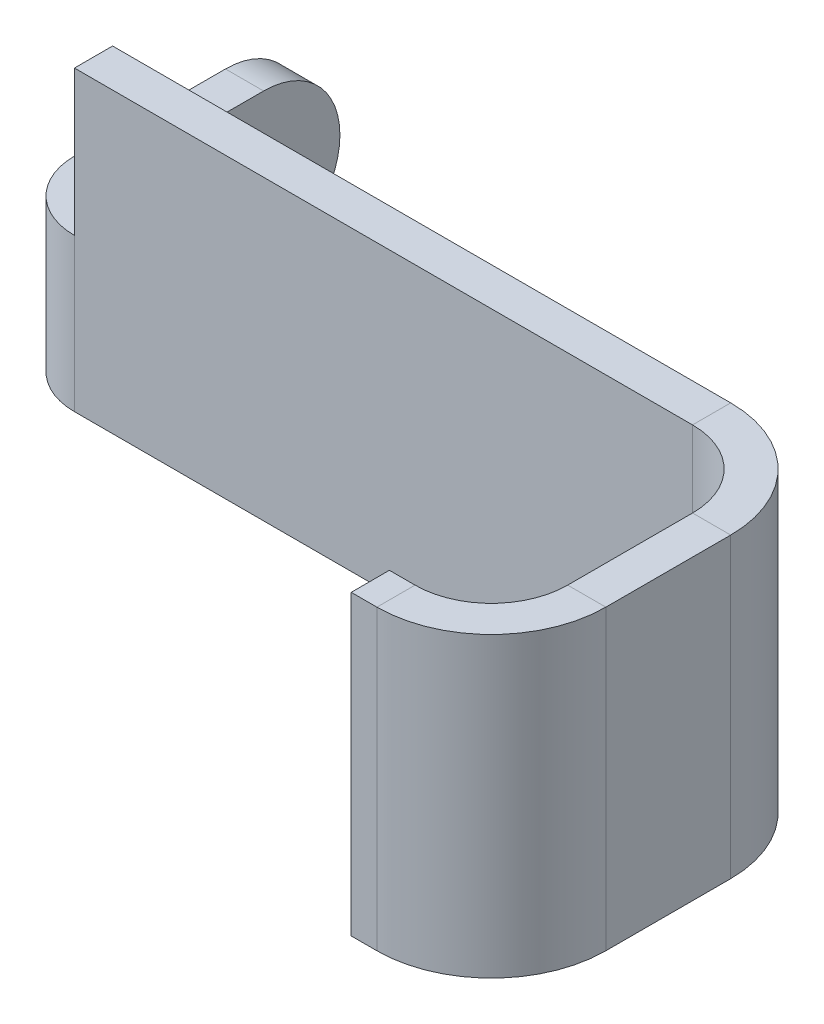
ISO-10303-21;
HEADER;
FILE_DESCRIPTION(('STEP AP214'),'2;1');
FILE_NAME('part.step','',(''),(''),'','','');
FILE_SCHEMA(('AUTOMOTIVE_DESIGN { 1 0 10303 214 1 1 1 1 }'));
ENDSEC;
DATA;
#1=APPLICATION_CONTEXT('core data for automotive mechanical design processes');
#2=APPLICATION_PROTOCOL_DEFINITION('international standard','automotive_design',2000,#1);
#3=PRODUCT_CONTEXT('',#1,'mechanical');
#4=PRODUCT('Part','Part','',(#3));
#5=PRODUCT_RELATED_PRODUCT_CATEGORY('part','',(#4));
#6=PRODUCT_DEFINITION_FORMATION('','',#4);
#7=PRODUCT_DEFINITION_CONTEXT('part definition',#1,'design');
#8=PRODUCT_DEFINITION('design','',#6,#7);
#9=PRODUCT_DEFINITION_SHAPE('','',#8);
#10=(LENGTH_UNIT() NAMED_UNIT(*) SI_UNIT(.MILLI.,.METRE.));
#11=(NAMED_UNIT(*) PLANE_ANGLE_UNIT() SI_UNIT($,.RADIAN.));
#12=(NAMED_UNIT(*) SI_UNIT($,.STERADIAN.) SOLID_ANGLE_UNIT());
#13=UNCERTAINTY_MEASURE_WITH_UNIT(LENGTH_MEASURE(1.E-05),#10,'distance_accuracy_value','');
#14=(GEOMETRIC_REPRESENTATION_CONTEXT(3) GLOBAL_UNCERTAINTY_ASSIGNED_CONTEXT((#13)) GLOBAL_UNIT_ASSIGNED_CONTEXT((#10,
#11,#12)) REPRESENTATION_CONTEXT('',''));
#15=CARTESIAN_POINT('',(0.,0.,0.));
#16=DIRECTION('',(0.,0.,1.));
#17=DIRECTION('',(1.,0.,0.));
#18=AXIS2_PLACEMENT_3D('',#15,#16,#17);
#19=CARTESIAN_POINT('',(9.01398601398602,0.,-0.25));
#20=DIRECTION('',(0.,-1.,0.));
#21=DIRECTION('',(1.,0.,0.));
#22=AXIS2_PLACEMENT_3D('',#19,#20,#21);
#23=PLANE('',#22);
#24=DIRECTION('',(1.,0.,0.));
#25=VECTOR('',#24,1.);
#26=CARTESIAN_POINT('',(9.01398601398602,0.,0.));
#27=LINE('',#26,#25);
#28=CARTESIAN_POINT('',(2.01398601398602,0.,0.));
#29=VERTEX_POINT('',#28);
#30=CARTESIAN_POINT('',(6.06398601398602,0.,0.));
#31=VERTEX_POINT('',#30);
#32=EDGE_CURVE('E351',#29,#31,#27,.T.);
#33=ORIENTED_EDGE('',*,*,#32,.F.);
#34=DIRECTION('',(0.,0.,-1.));
#35=VECTOR('',#34,1.);
#36=CARTESIAN_POINT('',(2.01398601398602,0.,-0.25));
#37=LINE('',#36,#35);
#38=CARTESIAN_POINT('',(2.01398601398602,0.,-0.25));
#39=VERTEX_POINT('',#38);
#40=EDGE_CURVE('E421',#29,#39,#37,.T.);
#41=ORIENTED_EDGE('',*,*,#40,.T.);
#42=DIRECTION('',(1.,0.,0.));
#43=VECTOR('',#42,1.);
#44=CARTESIAN_POINT('',(9.01398601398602,0.,-0.25));
#45=LINE('',#44,#43);
#46=CARTESIAN_POINT('',(6.06398601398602,0.,-0.25));
#47=VERTEX_POINT('',#46);
#48=EDGE_CURVE('E57',#39,#47,#45,.T.);
#49=ORIENTED_EDGE('',*,*,#48,.T.);
#50=DIRECTION('',(0.,0.,1.));
#51=VECTOR('',#50,1.);
#52=CARTESIAN_POINT('',(6.06398601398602,0.,-0.25));
#53=LINE('',#52,#51);
#54=EDGE_CURVE('E359',#47,#31,#53,.T.);
#55=ORIENTED_EDGE('',*,*,#54,.T.);
#56=EDGE_LOOP('',(#33,#41,#49,#55));
#57=FACE_BOUND('',#56,.T.);
#58=ADVANCED_FACE('F53',(#57),#23,.T.);
#59=CARTESIAN_POINT('',(0.,0.,-0.25));
#60=DIRECTION('',(0.,0.,-1.));
#61=DIRECTION('',(-1.,0.,0.));
#62=AXIS2_PLACEMENT_3D('',#59,#60,#61);
#63=PLANE('',#62);
#64=ORIENTED_EDGE('',*,*,#48,.F.);
#65=DIRECTION('',(0.,1.,0.));
#66=VECTOR('',#65,1.);
#67=CARTESIAN_POINT('',(2.01398601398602,0.,-0.25));
#68=LINE('',#67,#66);
#69=CARTESIAN_POINT('',(2.01398601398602,1.,-0.25));
#70=VERTEX_POINT('',#69);
#71=EDGE_CURVE('E405',#39,#70,#68,.T.);
#72=ORIENTED_EDGE('',*,*,#71,.T.);
#73=DIRECTION('',(0.,-1.,0.));
#74=VECTOR('',#73,1.);
#75=CARTESIAN_POINT('',(2.01398601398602,1.,-0.25));
#76=LINE('',#75,#74);
#77=CARTESIAN_POINT('',(2.01398601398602,1.95,-0.25));
#78=VERTEX_POINT('',#77);
#79=EDGE_CURVE('E367',#78,#70,#76,.T.);
#80=ORIENTED_EDGE('',*,*,#79,.F.);
#81=DIRECTION('',(-1.,0.,0.));
#82=VECTOR('',#81,1.);
#83=CARTESIAN_POINT('',(2.01398601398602,1.95,-0.25));
#84=LINE('',#83,#82);
#85=CARTESIAN_POINT('',(6.06398601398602,1.95,-0.25));
#86=VERTEX_POINT('',#85);
#87=EDGE_CURVE('E344',#86,#78,#84,.T.);
#88=ORIENTED_EDGE('',*,*,#87,.F.);
#89=DIRECTION('',(0.,-1.,0.));
#90=VECTOR('',#89,1.);
#91=CARTESIAN_POINT('',(6.06398601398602,0.,-0.25));
#92=LINE('',#91,#90);
#93=EDGE_CURVE('E363',#86,#47,#92,.T.);
#94=ORIENTED_EDGE('',*,*,#93,.T.);
#95=EDGE_LOOP('',(#64,#72,#80,#88,#94));
#96=FACE_BOUND('',#95,.T.);
#97=ADVANCED_FACE('F444',(#96),#63,.T.);
#98=CARTESIAN_POINT('',(6.81398601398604,0.,-6.54573371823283));
#99=DIRECTION('',(1.,0.,0.));
#100=DIRECTION('',(0.,0.,-1.));
#101=AXIS2_PLACEMENT_3D('',#98,#99,#100);
#102=PLANE('',#101);
#103=DIRECTION('',(0.,0.,-1.));
#104=VECTOR('',#103,1.);
#105=CARTESIAN_POINT('',(6.81398601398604,1.95,-4.53174770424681));
#106=LINE('',#105,#104);
#107=CARTESIAN_POINT('',(6.81398601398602,1.95,1.31825229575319));
#108=VERTEX_POINT('',#107);
#109=CARTESIAN_POINT('',(6.81398601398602,1.95,0.500000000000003));
#110=VERTEX_POINT('',#109);
#111=EDGE_CURVE('E379',#108,#110,#106,.T.);
#112=ORIENTED_EDGE('',*,*,#111,.F.);
#113=DIRECTION('',(0.,-1.,0.));
#114=VECTOR('',#113,1.);
#115=CARTESIAN_POINT('',(6.81398601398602,0.,1.31825229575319));
#116=LINE('',#115,#114);
#117=CARTESIAN_POINT('',(6.81398601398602,0.,1.31825229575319));
#118=VERTEX_POINT('',#117);
#119=EDGE_CURVE('E391',#108,#118,#116,.T.);
#120=ORIENTED_EDGE('',*,*,#119,.T.);
#121=DIRECTION('',(0.,0.,1.));
#122=VECTOR('',#121,1.);
#123=CARTESIAN_POINT('',(6.81398601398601,0.,2.46825229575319));
#124=LINE('',#123,#122);
#125=CARTESIAN_POINT('',(6.81398601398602,0.,0.500000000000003));
#126=VERTEX_POINT('',#125);
#127=EDGE_CURVE('E406',#126,#118,#124,.T.);
#128=ORIENTED_EDGE('',*,*,#127,.F.);
#129=DIRECTION('',(0.,-1.,0.));
#130=VECTOR('',#129,1.);
#131=CARTESIAN_POINT('',(6.81398601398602,0.,0.500000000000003));
#132=LINE('',#131,#130);
#133=EDGE_CURVE('E374',#110,#126,#132,.T.);
#134=ORIENTED_EDGE('',*,*,#133,.F.);
#135=EDGE_LOOP('',(#112,#120,#128,#134));
#136=FACE_BOUND('',#135,.T.);
#137=ADVANCED_FACE('F455',(#136),#102,.T.);
#138=CARTESIAN_POINT('',(6.81398601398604,1.95,-4.53174770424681));
#139=DIRECTION('',(0.,1.,0.));
#140=DIRECTION('',(-1.,0.,0.));
#141=AXIS2_PLACEMENT_3D('',#138,#139,#140);
#142=PLANE('',#141);
#143=DIRECTION('',(0.,0.,-1.));
#144=VECTOR('',#143,1.);
#145=CARTESIAN_POINT('',(6.56398601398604,1.95,-4.53174770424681));
#146=LINE('',#145,#144);
#147=CARTESIAN_POINT('',(6.56398601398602,1.95,1.31825229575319));
#148=VERTEX_POINT('',#147);
#149=CARTESIAN_POINT('',(6.56398601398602,1.95,0.500000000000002));
#150=VERTEX_POINT('',#149);
#151=EDGE_CURVE('E410',#148,#150,#146,.T.);
#152=ORIENTED_EDGE('',*,*,#151,.F.);
#153=DIRECTION('',(1.,0.,0.));
#154=VECTOR('',#153,1.);
#155=CARTESIAN_POINT('',(6.81398601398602,1.95,1.31825229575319));
#156=LINE('',#155,#154);
#157=EDGE_CURVE('E395',#148,#108,#156,.T.);
#158=ORIENTED_EDGE('',*,*,#157,.T.);
#159=ORIENTED_EDGE('',*,*,#111,.T.);
#160=DIRECTION('',(1.,0.,0.));
#161=VECTOR('',#160,1.);
#162=CARTESIAN_POINT('',(6.81398601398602,1.95,0.500000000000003));
#163=LINE('',#162,#161);
#164=EDGE_CURVE('E387',#150,#110,#163,.T.);
#165=ORIENTED_EDGE('',*,*,#164,.F.);
#166=EDGE_LOOP('',(#152,#158,#159,#165));
#167=FACE_BOUND('',#166,.T.);
#168=ADVANCED_FACE('F461',(#167),#142,.T.);
#169=CARTESIAN_POINT('',(6.81398601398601,0.,2.46825229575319));
#170=DIRECTION('',(0.,-1.,0.));
#171=DIRECTION('',(0.,0.,1.));
#172=AXIS2_PLACEMENT_3D('',#169,#170,#171);
#173=PLANE('',#172);
#174=ORIENTED_EDGE('',*,*,#127,.T.);
#175=DIRECTION('',(-1.,0.,0.));
#176=VECTOR('',#175,1.);
#177=CARTESIAN_POINT('',(6.81398601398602,0.,1.31825229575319));
#178=LINE('',#177,#176);
#179=CARTESIAN_POINT('',(6.56398601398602,0.,1.31825229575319));
#180=VERTEX_POINT('',#179);
#181=EDGE_CURVE('E401',#118,#180,#178,.T.);
#182=ORIENTED_EDGE('',*,*,#181,.T.);
#183=DIRECTION('',(0.,0.,1.));
#184=VECTOR('',#183,1.);
#185=CARTESIAN_POINT('',(6.56398601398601,0.,2.46825229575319));
#186=LINE('',#185,#184);
#187=CARTESIAN_POINT('',(6.56398601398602,0.,0.500000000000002));
#188=VERTEX_POINT('',#187);
#189=EDGE_CURVE('E343',#188,#180,#186,.T.);
#190=ORIENTED_EDGE('',*,*,#189,.F.);
#191=DIRECTION('',(-1.,0.,0.));
#192=VECTOR('',#191,1.);
#193=CARTESIAN_POINT('',(6.81398601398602,0.,0.500000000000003));
#194=LINE('',#193,#192);
#195=EDGE_CURVE('E378',#126,#188,#194,.T.);
#196=ORIENTED_EDGE('',*,*,#195,.F.);
#197=EDGE_LOOP('',(#174,#182,#190,#196));
#198=FACE_BOUND('',#197,.T.);
#199=ADVANCED_FACE('F465',(#198),#173,.T.);
#200=CARTESIAN_POINT('',(6.56398601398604,0.,-6.54573371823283));
#201=DIRECTION('',(1.,0.,0.));
#202=DIRECTION('',(0.,0.,-1.));
#203=AXIS2_PLACEMENT_3D('',#200,#201,#202);
#204=PLANE('',#203);
#205=DIRECTION('',(0.,-1.,0.));
#206=VECTOR('',#205,1.);
#207=CARTESIAN_POINT('',(6.56398601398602,0.,1.31825229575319));
#208=LINE('',#207,#206);
#209=EDGE_CURVE('E78',#148,#180,#208,.T.);
#210=ORIENTED_EDGE('',*,*,#209,.F.);
#211=ORIENTED_EDGE('',*,*,#151,.T.);
#212=DIRECTION('',(0.,-1.,0.));
#213=VECTOR('',#212,1.);
#214=CARTESIAN_POINT('',(6.56398601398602,0.,0.500000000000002));
#215=LINE('',#214,#213);
#216=EDGE_CURVE('E383',#150,#188,#215,.T.);
#217=ORIENTED_EDGE('',*,*,#216,.T.);
#218=ORIENTED_EDGE('',*,*,#189,.T.);
#219=EDGE_LOOP('',(#210,#211,#217,#218));
#220=FACE_BOUND('',#219,.T.);
#221=ADVANCED_FACE('F463',(#220),#204,.F.);
#222=CARTESIAN_POINT('',(2.01398601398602,1.,-0.25));
#223=DIRECTION('',(-1.,0.,0.));
#224=DIRECTION('',(0.,0.,1.));
#225=AXIS2_PLACEMENT_3D('',#222,#223,#224);
#226=PLANE('',#225);
#227=DIRECTION('',(0.,-1.,0.));
#228=VECTOR('',#227,1.);
#229=CARTESIAN_POINT('',(2.01398601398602,1.,0.));
#230=LINE('',#229,#228);
#231=CARTESIAN_POINT('',(2.01398601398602,1.95,0.));
#232=VERTEX_POINT('',#231);
#233=CARTESIAN_POINT('',(2.01398601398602,1.,0.));
#234=VERTEX_POINT('',#233);
#235=EDGE_CURVE('E352',#232,#234,#230,.T.);
#236=ORIENTED_EDGE('',*,*,#235,.F.);
#237=DIRECTION('',(0.,0.,1.));
#238=VECTOR('',#237,1.);
#239=CARTESIAN_POINT('',(2.01398601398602,1.95,-0.25));
#240=LINE('',#239,#238);
#241=EDGE_CURVE('E339',#78,#232,#240,.T.);
#242=ORIENTED_EDGE('',*,*,#241,.F.);
#243=ORIENTED_EDGE('',*,*,#79,.T.);
#244=DIRECTION('',(0.,0.,1.));
#245=VECTOR('',#244,1.);
#246=CARTESIAN_POINT('',(2.01398601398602,1.,-0.25));
#247=LINE('',#246,#245);
#248=EDGE_CURVE('E12',#70,#234,#247,.T.);
#249=ORIENTED_EDGE('',*,*,#248,.T.);
#250=EDGE_LOOP('',(#236,#242,#243,#249));
#251=FACE_BOUND('',#250,.T.);
#252=ADVANCED_FACE('F512',(#251),#226,.T.);
#253=CARTESIAN_POINT('',(0.,0.,0.));
#254=DIRECTION('',(0.,0.,-1.));
#255=DIRECTION('',(-1.,0.,0.));
#256=AXIS2_PLACEMENT_3D('',#253,#254,#255);
#257=PLANE('',#256);
#258=DIRECTION('',(0.,1.,0.));
#259=VECTOR('',#258,1.);
#260=CARTESIAN_POINT('',(2.01398601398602,0.,0.));
#261=LINE('',#260,#259);
#262=EDGE_CURVE('E63',#29,#234,#261,.T.);
#263=ORIENTED_EDGE('',*,*,#262,.F.);
#264=ORIENTED_EDGE('',*,*,#32,.T.);
#265=DIRECTION('',(0.,-1.,0.));
#266=VECTOR('',#265,1.);
#267=CARTESIAN_POINT('',(6.06398601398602,0.,0.));
#268=LINE('',#267,#266);
#269=CARTESIAN_POINT('',(6.06398601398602,1.95,0.));
#270=VERTEX_POINT('',#269);
#271=EDGE_CURVE('E332',#270,#31,#268,.T.);
#272=ORIENTED_EDGE('',*,*,#271,.F.);
#273=DIRECTION('',(-1.,0.,0.));
#274=VECTOR('',#273,1.);
#275=CARTESIAN_POINT('',(2.01398601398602,1.95,0.));
#276=LINE('',#275,#274);
#277=EDGE_CURVE('E356',#270,#232,#276,.T.);
#278=ORIENTED_EDGE('',*,*,#277,.T.);
#279=ORIENTED_EDGE('',*,*,#235,.T.);
#280=EDGE_LOOP('',(#263,#264,#272,#278,#279));
#281=FACE_BOUND('',#280,.T.);
#282=ADVANCED_FACE('F55',(#281),#257,.F.);
#283=CARTESIAN_POINT('',(2.01398601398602,1.95,-0.25));
#284=DIRECTION('',(0.,1.,0.));
#285=DIRECTION('',(0.,0.,1.));
#286=AXIS2_PLACEMENT_3D('',#283,#284,#285);
#287=PLANE('',#286);
#288=ORIENTED_EDGE('',*,*,#277,.F.);
#289=DIRECTION('',(0.,0.,-1.));
#290=VECTOR('',#289,1.);
#291=CARTESIAN_POINT('',(6.06398601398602,1.95,-0.25));
#292=LINE('',#291,#290);
#293=EDGE_CURVE('E347',#270,#86,#292,.T.);
#294=ORIENTED_EDGE('',*,*,#293,.T.);
#295=ORIENTED_EDGE('',*,*,#87,.T.);
#296=ORIENTED_EDGE('',*,*,#241,.T.);
#297=EDGE_LOOP('',(#288,#294,#295,#296));
#298=FACE_BOUND('',#297,.T.);
#299=ADVANCED_FACE('F517',(#298),#287,.T.);
#300=CARTESIAN_POINT('',(6.06398601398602,1.95,0.5));
#301=DIRECTION('',(0.,1.,0.));
#302=DIRECTION('',(0.,0.,1.));
#303=AXIS2_PLACEMENT_3D('',#300,#301,#302);
#304=PLANE('',#303);
#305=ORIENTED_EDGE('',*,*,#293,.F.);
#306=CARTESIAN_POINT('',(6.06398601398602,1.95,0.5));
#307=DIRECTION('',(0.,-1.,0.));
#308=DIRECTION('',(0.,0.,-1.));
#309=AXIS2_PLACEMENT_3D('',#306,#307,#308);
#310=CIRCLE('',#309,0.5);
#311=EDGE_CURVE('E317',#270,#150,#310,.T.);
#312=ORIENTED_EDGE('',*,*,#311,.T.);
#313=ORIENTED_EDGE('',*,*,#164,.T.);
#314=CARTESIAN_POINT('',(6.06398601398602,1.95,0.5));
#315=DIRECTION('',(0.,-1.,0.));
#316=DIRECTION('',(0.,0.,1.));
#317=AXIS2_PLACEMENT_3D('',#314,#315,#316);
#318=CIRCLE('',#317,0.75);
#319=EDGE_CURVE('E323',#86,#110,#318,.T.);
#320=ORIENTED_EDGE('',*,*,#319,.F.);
#321=EDGE_LOOP('',(#305,#312,#313,#320));
#322=FACE_BOUND('',#321,.T.);
#323=ADVANCED_FACE('F458',(#322),#304,.T.);
#324=CARTESIAN_POINT('',(6.06398601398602,0.,0.5));
#325=DIRECTION('',(0.,-1.,0.));
#326=DIRECTION('',(0.,0.,-1.));
#327=AXIS2_PLACEMENT_3D('',#324,#325,#326);
#328=PLANE('',#327);
#329=ORIENTED_EDGE('',*,*,#195,.T.);
#330=CARTESIAN_POINT('',(6.06398601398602,0.,0.5));
#331=DIRECTION('',(0.,-1.,0.));
#332=DIRECTION('',(0.,0.,-1.));
#333=AXIS2_PLACEMENT_3D('',#330,#331,#332);
#334=CIRCLE('',#333,0.5);
#335=EDGE_CURVE('E328',#188,#31,#334,.F.);
#336=ORIENTED_EDGE('',*,*,#335,.T.);
#337=ORIENTED_EDGE('',*,*,#54,.F.);
#338=CARTESIAN_POINT('',(6.06398601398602,0.,0.5));
#339=DIRECTION('',(0.,1.,0.));
#340=DIRECTION('',(0.,0.,-1.));
#341=AXIS2_PLACEMENT_3D('',#338,#339,#340);
#342=CIRCLE('',#341,0.75);
#343=EDGE_CURVE('E327',#126,#47,#342,.T.);
#344=ORIENTED_EDGE('',*,*,#343,.F.);
#345=EDGE_LOOP('',(#329,#336,#337,#344));
#346=FACE_BOUND('',#345,.T.);
#347=ADVANCED_FACE('F439',(#346),#328,.T.);
#348=CARTESIAN_POINT('',(6.06398601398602,3.17245956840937,0.5));
#349=DIRECTION('',(0.,-1.,0.));
#350=DIRECTION('',(0.,0.,-1.));
#351=AXIS2_PLACEMENT_3D('',#348,#349,#350);
#352=CYLINDRICAL_SURFACE('',#351,0.75);
#353=ORIENTED_EDGE('',*,*,#343,.T.);
#354=ORIENTED_EDGE('',*,*,#93,.F.);
#355=ORIENTED_EDGE('',*,*,#319,.T.);
#356=ORIENTED_EDGE('',*,*,#133,.T.);
#357=EDGE_LOOP('',(#353,#354,#355,#356));
#358=FACE_BOUND('',#357,.T.);
#359=ADVANCED_FACE('F450',(#358),#352,.T.);
#360=CARTESIAN_POINT('',(6.06398601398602,3.17245956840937,0.5));
#361=DIRECTION('',(0.,-1.,0.));
#362=DIRECTION('',(0.,0.,-1.));
#363=AXIS2_PLACEMENT_3D('',#360,#361,#362);
#364=CYLINDRICAL_SURFACE('',#363,0.5);
#365=ORIENTED_EDGE('',*,*,#335,.F.);
#366=ORIENTED_EDGE('',*,*,#216,.F.);
#367=ORIENTED_EDGE('',*,*,#311,.F.);
#368=ORIENTED_EDGE('',*,*,#271,.T.);
#369=EDGE_LOOP('',(#365,#366,#367,#368));
#370=FACE_BOUND('',#369,.T.);
#371=ADVANCED_FACE('F434',(#370),#364,.F.);
#372=CARTESIAN_POINT('',(6.06398601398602,1.95,1.31825229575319));
#373=DIRECTION('',(0.,1.,0.));
#374=DIRECTION('',(0.,0.,1.));
#375=AXIS2_PLACEMENT_3D('',#372,#373,#374);
#376=PLANE('',#375);
#377=ORIENTED_EDGE('',*,*,#157,.F.);
#378=CARTESIAN_POINT('',(6.06398601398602,1.95,1.31825229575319));
#379=DIRECTION('',(0.,-1.,0.));
#380=DIRECTION('',(0.,0.,-1.));
#381=AXIS2_PLACEMENT_3D('',#378,#379,#380);
#382=CIRCLE('',#381,0.5);
#383=CARTESIAN_POINT('',(6.06398601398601,1.95,1.81825229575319));
#384=VERTEX_POINT('',#383);
#385=EDGE_CURVE('E268',#148,#384,#382,.T.);
#386=ORIENTED_EDGE('',*,*,#385,.T.);
#387=DIRECTION('',(0.,0.,1.));
#388=VECTOR('',#387,1.);
#389=CARTESIAN_POINT('',(6.06398601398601,1.95,2.06825229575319));
#390=LINE('',#389,#388);
#391=CARTESIAN_POINT('',(6.06398601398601,1.95,2.06825229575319));
#392=VERTEX_POINT('',#391);
#393=EDGE_CURVE('E297',#384,#392,#390,.T.);
#394=ORIENTED_EDGE('',*,*,#393,.T.);
#395=CARTESIAN_POINT('',(6.06398601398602,1.95,1.31825229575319));
#396=DIRECTION('',(0.,-1.,0.));
#397=DIRECTION('',(0.,0.,1.));
#398=AXIS2_PLACEMENT_3D('',#395,#396,#397);
#399=CIRCLE('',#398,0.75);
#400=EDGE_CURVE('E308',#108,#392,#399,.T.);
#401=ORIENTED_EDGE('',*,*,#400,.F.);
#402=EDGE_LOOP('',(#377,#386,#394,#401));
#403=FACE_BOUND('',#402,.T.);
#404=ADVANCED_FACE('F483',(#403),#376,.T.);
#405=CARTESIAN_POINT('',(6.06398601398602,0.,1.31825229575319));
#406=DIRECTION('',(0.,-1.,0.));
#407=DIRECTION('',(0.,0.,-1.));
#408=AXIS2_PLACEMENT_3D('',#405,#406,#407);
#409=PLANE('',#408);
#410=DIRECTION('',(0.,0.,-1.));
#411=VECTOR('',#410,1.);
#412=CARTESIAN_POINT('',(6.06398601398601,0.,2.06825229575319));
#413=LINE('',#412,#411);
#414=CARTESIAN_POINT('',(6.06398601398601,0.,2.06825229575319));
#415=VERTEX_POINT('',#414);
#416=CARTESIAN_POINT('',(6.06398601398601,0.,1.81825229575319));
#417=VERTEX_POINT('',#416);
#418=EDGE_CURVE('E301',#415,#417,#413,.T.);
#419=ORIENTED_EDGE('',*,*,#418,.T.);
#420=CARTESIAN_POINT('',(6.06398601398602,0.,1.31825229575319));
#421=DIRECTION('',(0.,-1.,0.));
#422=DIRECTION('',(0.,0.,-1.));
#423=AXIS2_PLACEMENT_3D('',#420,#421,#422);
#424=CIRCLE('',#423,0.5);
#425=EDGE_CURVE('E313',#417,#180,#424,.F.);
#426=ORIENTED_EDGE('',*,*,#425,.T.);
#427=ORIENTED_EDGE('',*,*,#181,.F.);
#428=CARTESIAN_POINT('',(6.06398601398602,0.,1.31825229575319));
#429=DIRECTION('',(0.,1.,0.));
#430=DIRECTION('',(0.,0.,-1.));
#431=AXIS2_PLACEMENT_3D('',#428,#429,#430);
#432=CIRCLE('',#431,0.75);
#433=EDGE_CURVE('E312',#415,#118,#432,.T.);
#434=ORIENTED_EDGE('',*,*,#433,.F.);
#435=EDGE_LOOP('',(#419,#426,#427,#434));
#436=FACE_BOUND('',#435,.T.);
#437=ADVANCED_FACE('F468',(#436),#409,.T.);
#438=CARTESIAN_POINT('',(6.06398601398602,3.17245956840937,1.31825229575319));
#439=DIRECTION('',(0.,-1.,0.));
#440=DIRECTION('',(0.,0.,-1.));
#441=AXIS2_PLACEMENT_3D('',#438,#439,#440);
#442=CYLINDRICAL_SURFACE('',#441,0.75);
#443=ORIENTED_EDGE('',*,*,#433,.T.);
#444=ORIENTED_EDGE('',*,*,#119,.F.);
#445=ORIENTED_EDGE('',*,*,#400,.T.);
#446=DIRECTION('',(0.,-1.,0.));
#447=VECTOR('',#446,1.);
#448=CARTESIAN_POINT('',(6.06398601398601,0.,2.06825229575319));
#449=LINE('',#448,#447);
#450=EDGE_CURVE('E261',#392,#415,#449,.T.);
#451=ORIENTED_EDGE('',*,*,#450,.T.);
#452=EDGE_LOOP('',(#443,#444,#445,#451));
#453=FACE_BOUND('',#452,.T.);
#454=ADVANCED_FACE('F471',(#453),#442,.T.);
#455=CARTESIAN_POINT('',(6.06398601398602,3.17245956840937,1.31825229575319));
#456=DIRECTION('',(0.,-1.,0.));
#457=DIRECTION('',(0.,0.,-1.));
#458=AXIS2_PLACEMENT_3D('',#455,#456,#457);
#459=CYLINDRICAL_SURFACE('',#458,0.5);
#460=ORIENTED_EDGE('',*,*,#425,.F.);
#461=DIRECTION('',(0.,-1.,0.));
#462=VECTOR('',#461,1.);
#463=CARTESIAN_POINT('',(6.06398601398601,0.,1.81825229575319));
#464=LINE('',#463,#462);
#465=EDGE_CURVE('E279',#384,#417,#464,.T.);
#466=ORIENTED_EDGE('',*,*,#465,.F.);
#467=ORIENTED_EDGE('',*,*,#385,.F.);
#468=ORIENTED_EDGE('',*,*,#209,.T.);
#469=EDGE_LOOP('',(#460,#466,#467,#468));
#470=FACE_BOUND('',#469,.T.);
#471=ADVANCED_FACE('F484',(#470),#459,.F.);
#472=CARTESIAN_POINT('',(5.89573371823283,1.95,2.06825229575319));
#473=DIRECTION('',(-1.,0.,0.));
#474=DIRECTION('',(0.,0.,1.));
#475=AXIS2_PLACEMENT_3D('',#472,#473,#474);
#476=PLANE('',#475);
#477=DIRECTION('',(0.,1.,0.));
#478=VECTOR('',#477,1.);
#479=CARTESIAN_POINT('',(5.89573371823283,1.95,1.81825229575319));
#480=LINE('',#479,#478);
#481=CARTESIAN_POINT('',(5.89573371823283,0.,1.81825229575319));
#482=VERTEX_POINT('',#481);
#483=CARTESIAN_POINT('',(5.89573371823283,1.95,1.81825229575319));
#484=VERTEX_POINT('',#483);
#485=EDGE_CURVE('E272',#482,#484,#480,.T.);
#486=ORIENTED_EDGE('',*,*,#485,.F.);
#487=DIRECTION('',(0.,0.,-1.));
#488=VECTOR('',#487,1.);
#489=CARTESIAN_POINT('',(5.89573371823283,0.,2.06825229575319));
#490=LINE('',#489,#488);
#491=CARTESIAN_POINT('',(5.89573371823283,0.,2.06825229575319));
#492=VERTEX_POINT('',#491);
#493=EDGE_CURVE('E264',#492,#482,#490,.T.);
#494=ORIENTED_EDGE('',*,*,#493,.F.);
#495=DIRECTION('',(0.,1.,0.));
#496=VECTOR('',#495,1.);
#497=CARTESIAN_POINT('',(5.89573371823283,1.95,2.06825229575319));
#498=LINE('',#497,#496);
#499=CARTESIAN_POINT('',(5.89573371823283,1.95,2.06825229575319));
#500=VERTEX_POINT('',#499);
#501=EDGE_CURVE('E293',#492,#500,#498,.T.);
#502=ORIENTED_EDGE('',*,*,#501,.T.);
#503=DIRECTION('',(0.,0.,-1.));
#504=VECTOR('',#503,1.);
#505=CARTESIAN_POINT('',(5.89573371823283,1.95,2.06825229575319));
#506=LINE('',#505,#504);
#507=EDGE_CURVE('E290',#500,#484,#506,.T.);
#508=ORIENTED_EDGE('',*,*,#507,.T.);
#509=EDGE_LOOP('',(#486,#494,#502,#508));
#510=FACE_BOUND('',#509,.T.);
#511=ADVANCED_FACE('F492',(#510),#476,.T.);
#512=CARTESIAN_POINT('',(14.9097197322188,0.,2.06825229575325));
#513=DIRECTION('',(0.,0.,1.));
#514=DIRECTION('',(1.,0.,0.));
#515=AXIS2_PLACEMENT_3D('',#512,#513,#514);
#516=PLANE('',#515);
#517=ORIENTED_EDGE('',*,*,#450,.F.);
#518=DIRECTION('',(1.,0.,0.));
#519=VECTOR('',#518,1.);
#520=CARTESIAN_POINT('',(12.8957337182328,1.95,2.06825229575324));
#521=LINE('',#520,#519);
#522=EDGE_CURVE('E286',#500,#392,#521,.T.);
#523=ORIENTED_EDGE('',*,*,#522,.F.);
#524=ORIENTED_EDGE('',*,*,#501,.F.);
#525=DIRECTION('',(-1.,0.,0.));
#526=VECTOR('',#525,1.);
#527=CARTESIAN_POINT('',(5.89573371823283,0.,2.06825229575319));
#528=LINE('',#527,#526);
#529=EDGE_CURVE('E269',#415,#492,#528,.T.);
#530=ORIENTED_EDGE('',*,*,#529,.F.);
#531=EDGE_LOOP('',(#517,#523,#524,#530));
#532=FACE_BOUND('',#531,.T.);
#533=ADVANCED_FACE('F475',(#532),#516,.T.);
#534=CARTESIAN_POINT('',(12.8957337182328,1.95,2.06825229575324));
#535=DIRECTION('',(0.,1.,0.));
#536=DIRECTION('',(0.,0.,-1.));
#537=AXIS2_PLACEMENT_3D('',#534,#535,#536);
#538=PLANE('',#537);
#539=ORIENTED_EDGE('',*,*,#393,.F.);
#540=DIRECTION('',(1.,0.,0.));
#541=VECTOR('',#540,1.);
#542=CARTESIAN_POINT('',(12.8957337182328,1.95,1.81825229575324));
#543=LINE('',#542,#541);
#544=EDGE_CURVE('E283',#484,#384,#543,.T.);
#545=ORIENTED_EDGE('',*,*,#544,.F.);
#546=ORIENTED_EDGE('',*,*,#507,.F.);
#547=ORIENTED_EDGE('',*,*,#522,.T.);
#548=EDGE_LOOP('',(#539,#545,#546,#547));
#549=FACE_BOUND('',#548,.T.);
#550=ADVANCED_FACE('F479',(#549),#538,.T.);
#551=CARTESIAN_POINT('',(14.9097197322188,0.,1.81825229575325));
#552=DIRECTION('',(0.,0.,1.));
#553=DIRECTION('',(1.,0.,0.));
#554=AXIS2_PLACEMENT_3D('',#551,#552,#553);
#555=PLANE('',#554);
#556=ORIENTED_EDGE('',*,*,#544,.T.);
#557=ORIENTED_EDGE('',*,*,#465,.T.);
#558=DIRECTION('',(-1.,0.,0.));
#559=VECTOR('',#558,1.);
#560=CARTESIAN_POINT('',(5.89573371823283,0.,1.81825229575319));
#561=LINE('',#560,#559);
#562=EDGE_CURVE('E276',#417,#482,#561,.T.);
#563=ORIENTED_EDGE('',*,*,#562,.T.);
#564=ORIENTED_EDGE('',*,*,#485,.T.);
#565=EDGE_LOOP('',(#556,#557,#563,#564));
#566=FACE_BOUND('',#565,.T.);
#567=ADVANCED_FACE('F486',(#566),#555,.F.);
#568=CARTESIAN_POINT('',(5.89573371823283,0.,2.06825229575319));
#569=DIRECTION('',(0.,-1.,0.));
#570=DIRECTION('',(-1.,0.,0.));
#571=AXIS2_PLACEMENT_3D('',#568,#569,#570);
#572=PLANE('',#571);
#573=ORIENTED_EDGE('',*,*,#418,.F.);
#574=ORIENTED_EDGE('',*,*,#529,.T.);
#575=ORIENTED_EDGE('',*,*,#493,.T.);
#576=ORIENTED_EDGE('',*,*,#562,.F.);
#577=EDGE_LOOP('',(#573,#574,#575,#576));
#578=FACE_BOUND('',#577,.T.);
#579=ADVANCED_FACE('F488',(#578),#572,.T.);
#580=CARTESIAN_POINT('',(2.01398601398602,0.,-0.45));
#581=DIRECTION('',(0.,1.,0.));
#582=DIRECTION('',(0.,0.,1.));
#583=AXIS2_PLACEMENT_3D('',#580,#581,#582);
#584=PLANE('',#583);
#585=ORIENTED_EDGE('',*,*,#40,.F.);
#586=CARTESIAN_POINT('',(2.01398601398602,0.,-0.45));
#587=DIRECTION('',(0.,1.,0.));
#588=DIRECTION('',(0.,0.,1.));
#589=AXIS2_PLACEMENT_3D('',#586,#587,#588);
#590=CIRCLE('',#589,0.45);
#591=CARTESIAN_POINT('',(1.56398601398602,0.,-0.450000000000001));
#592=VERTEX_POINT('',#591);
#593=EDGE_CURVE('E211',#29,#592,#590,.F.);
#594=ORIENTED_EDGE('',*,*,#593,.T.);
#595=DIRECTION('',(1.,0.,0.));
#596=VECTOR('',#595,1.);
#597=CARTESIAN_POINT('',(1.81398601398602,0.,-0.45));
#598=LINE('',#597,#596);
#599=CARTESIAN_POINT('',(1.81398601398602,0.,-0.45));
#600=VERTEX_POINT('',#599);
#601=EDGE_CURVE('E244',#592,#600,#598,.T.);
#602=ORIENTED_EDGE('',*,*,#601,.T.);
#603=CARTESIAN_POINT('',(2.01398601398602,0.,-0.45));
#604=DIRECTION('',(0.,-1.,0.));
#605=DIRECTION('',(0.,0.,1.));
#606=AXIS2_PLACEMENT_3D('',#603,#604,#605);
#607=CIRCLE('',#606,0.2);
#608=EDGE_CURVE('E253',#39,#600,#607,.T.);
#609=ORIENTED_EDGE('',*,*,#608,.F.);
#610=EDGE_LOOP('',(#585,#594,#602,#609));
#611=FACE_BOUND('',#610,.T.);
#612=ADVANCED_FACE('F540',(#611),#584,.F.);
#613=CARTESIAN_POINT('',(2.01398601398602,1.,-0.45));
#614=DIRECTION('',(0.,-1.,0.));
#615=DIRECTION('',(0.,0.,-1.));
#616=AXIS2_PLACEMENT_3D('',#613,#614,#615);
#617=PLANE('',#616);
#618=DIRECTION('',(-1.,0.,0.));
#619=VECTOR('',#618,1.);
#620=CARTESIAN_POINT('',(1.81398601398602,1.,-0.450000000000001));
#621=LINE('',#620,#619);
#622=CARTESIAN_POINT('',(1.81398601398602,1.,-0.450000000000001));
#623=VERTEX_POINT('',#622);
#624=CARTESIAN_POINT('',(1.56398601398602,1.,-0.450000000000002));
#625=VERTEX_POINT('',#624);
#626=EDGE_CURVE('E191',#623,#625,#621,.T.);
#627=ORIENTED_EDGE('',*,*,#626,.T.);
#628=CARTESIAN_POINT('',(2.01398601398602,1.,-0.45));
#629=DIRECTION('',(0.,1.,0.));
#630=DIRECTION('',(0.,0.,1.));
#631=AXIS2_PLACEMENT_3D('',#628,#629,#630);
#632=CIRCLE('',#631,0.45);
#633=EDGE_CURVE('E215',#625,#234,#632,.T.);
#634=ORIENTED_EDGE('',*,*,#633,.T.);
#635=ORIENTED_EDGE('',*,*,#248,.F.);
#636=CARTESIAN_POINT('',(2.01398601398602,1.,-0.45));
#637=DIRECTION('',(0.,1.,0.));
#638=DIRECTION('',(0.,0.,-1.));
#639=AXIS2_PLACEMENT_3D('',#636,#637,#638);
#640=CIRCLE('',#639,0.2);
#641=EDGE_CURVE('E257',#623,#70,#640,.T.);
#642=ORIENTED_EDGE('',*,*,#641,.F.);
#643=EDGE_LOOP('',(#627,#634,#635,#642));
#644=FACE_BOUND('',#643,.T.);
#645=ADVANCED_FACE('F562',(#644),#617,.F.);
#646=CARTESIAN_POINT('',(2.01398601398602,-0.650269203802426,-0.45));
#647=DIRECTION('',(0.,1.,0.));
#648=DIRECTION('',(0.,0.,1.));
#649=AXIS2_PLACEMENT_3D('',#646,#647,#648);
#650=CYLINDRICAL_SURFACE('',#649,0.2);
#651=ORIENTED_EDGE('',*,*,#641,.T.);
#652=ORIENTED_EDGE('',*,*,#71,.F.);
#653=ORIENTED_EDGE('',*,*,#608,.T.);
#654=DIRECTION('',(0.,1.,0.));
#655=VECTOR('',#654,1.);
#656=CARTESIAN_POINT('',(1.81398601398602,0.,-0.450000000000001));
#657=LINE('',#656,#655);
#658=EDGE_CURVE('E250',#600,#623,#657,.T.);
#659=ORIENTED_EDGE('',*,*,#658,.T.);
#660=EDGE_LOOP('',(#651,#652,#653,#659));
#661=FACE_BOUND('',#660,.T.);
#662=ADVANCED_FACE('F570',(#661),#650,.F.);
#663=CARTESIAN_POINT('',(2.01398601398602,-0.650269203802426,-0.45));
#664=DIRECTION('',(0.,1.,0.));
#665=DIRECTION('',(0.,0.,1.));
#666=AXIS2_PLACEMENT_3D('',#663,#664,#665);
#667=CYLINDRICAL_SURFACE('',#666,0.45);
#668=ORIENTED_EDGE('',*,*,#633,.F.);
#669=DIRECTION('',(0.,1.,0.));
#670=VECTOR('',#669,1.);
#671=CARTESIAN_POINT('',(1.56398601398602,0.,-0.450000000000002));
#672=LINE('',#671,#670);
#673=EDGE_CURVE('E225',#592,#625,#672,.T.);
#674=ORIENTED_EDGE('',*,*,#673,.F.);
#675=ORIENTED_EDGE('',*,*,#593,.F.);
#676=ORIENTED_EDGE('',*,*,#262,.T.);
#677=EDGE_LOOP('',(#668,#674,#675,#676));
#678=FACE_BOUND('',#677,.T.);
#679=ADVANCED_FACE('F578',(#678),#667,.T.);
#680=CARTESIAN_POINT('',(1.81398601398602,0.5,-1.43949119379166));
#681=DIRECTION('',(-1.,0.,0.));
#682=DIRECTION('',(0.,0.,1.));
#683=AXIS2_PLACEMENT_3D('',#680,#681,#682);
#684=CYLINDRICAL_SURFACE('',#683,0.5);
#685=DIRECTION('',(-1.,0.,0.));
#686=VECTOR('',#685,1.);
#687=CARTESIAN_POINT('',(1.81398601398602,1.,-1.43949119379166));
#688=LINE('',#687,#686);
#689=CARTESIAN_POINT('',(1.81398601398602,1.,-1.43949119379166));
#690=VERTEX_POINT('',#689);
#691=CARTESIAN_POINT('',(1.56398601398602,1.,-1.43949119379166));
#692=VERTEX_POINT('',#691);
#693=EDGE_CURVE('E188',#690,#692,#688,.T.);
#694=ORIENTED_EDGE('',*,*,#693,.F.);
#695=CARTESIAN_POINT('',(1.81398601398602,0.5,-1.43949119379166));
#696=DIRECTION('',(1.,0.,0.));
#697=DIRECTION('',(0.,0.,-1.));
#698=AXIS2_PLACEMENT_3D('',#695,#696,#697);
#699=CIRCLE('',#698,0.5);
#700=CARTESIAN_POINT('',(1.81398601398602,0.5,-1.93949119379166));
#701=VERTEX_POINT('',#700);
#702=EDGE_CURVE('E198',#701,#690,#699,.T.);
#703=ORIENTED_EDGE('',*,*,#702,.F.);
#704=DIRECTION('',(-1.,0.,0.));
#705=VECTOR('',#704,1.);
#706=CARTESIAN_POINT('',(1.81398601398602,0.5,-1.93949119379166));
#707=LINE('',#706,#705);
#708=CARTESIAN_POINT('',(1.56398601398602,0.5,-1.93949119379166));
#709=VERTEX_POINT('',#708);
#710=EDGE_CURVE('E241',#709,#701,#707,.F.);
#711=ORIENTED_EDGE('',*,*,#710,.F.);
#712=CARTESIAN_POINT('',(1.56398601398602,0.5,-1.43949119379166));
#713=DIRECTION('',(1.,0.,0.));
#714=DIRECTION('',(0.,0.,-1.));
#715=AXIS2_PLACEMENT_3D('',#712,#713,#714);
#716=CIRCLE('',#715,0.5);
#717=EDGE_CURVE('E209',#692,#709,#716,.F.);
#718=ORIENTED_EDGE('',*,*,#717,.F.);
#719=EDGE_LOOP('',(#694,#703,#711,#718));
#720=FACE_BOUND('',#719,.T.);
#721=ADVANCED_FACE('F208',(#720),#684,.T.);
#722=CARTESIAN_POINT('',(1.81398601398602,0.5,-1.43949119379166));
#723=DIRECTION('',(-1.,0.,0.));
#724=DIRECTION('',(0.,0.,1.));
#725=AXIS2_PLACEMENT_3D('',#722,#723,#724);
#726=CYLINDRICAL_SURFACE('',#725,0.5);
#727=CARTESIAN_POINT('',(1.81398601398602,0.5,-1.43949119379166));
#728=DIRECTION('',(1.,0.,0.));
#729=DIRECTION('',(0.,0.,-1.));
#730=AXIS2_PLACEMENT_3D('',#727,#728,#729);
#731=CIRCLE('',#730,0.5);
#732=CARTESIAN_POINT('',(1.81398601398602,0.,-1.43949119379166));
#733=VERTEX_POINT('',#732);
#734=EDGE_CURVE('E201',#733,#701,#731,.T.);
#735=ORIENTED_EDGE('',*,*,#734,.F.);
#736=DIRECTION('',(-1.,0.,0.));
#737=VECTOR('',#736,1.);
#738=CARTESIAN_POINT('',(1.81398601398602,0.,-1.43949119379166));
#739=LINE('',#738,#737);
#740=CARTESIAN_POINT('',(1.56398601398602,0.,-1.43949119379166));
#741=VERTEX_POINT('',#740);
#742=EDGE_CURVE('E206',#741,#733,#739,.F.);
#743=ORIENTED_EDGE('',*,*,#742,.F.);
#744=CARTESIAN_POINT('',(1.56398601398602,0.5,-1.43949119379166));
#745=DIRECTION('',(1.,0.,0.));
#746=DIRECTION('',(0.,0.,-1.));
#747=AXIS2_PLACEMENT_3D('',#744,#745,#746);
#748=CIRCLE('',#747,0.5);
#749=EDGE_CURVE('E195',#709,#741,#748,.F.);
#750=ORIENTED_EDGE('',*,*,#749,.F.);
#751=ORIENTED_EDGE('',*,*,#710,.T.);
#752=EDGE_LOOP('',(#735,#743,#750,#751));
#753=FACE_BOUND('',#752,.T.);
#754=ADVANCED_FACE('F592',(#753),#726,.T.);
#755=CARTESIAN_POINT('',(1.81398601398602,0.,-1.95347720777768));
#756=DIRECTION('',(1.,0.,0.));
#757=DIRECTION('',(0.,0.,-1.));
#758=AXIS2_PLACEMENT_3D('',#755,#756,#757);
#759=PLANE('',#758);
#760=ORIENTED_EDGE('',*,*,#658,.F.);
#761=DIRECTION('',(0.,0.,1.));
#762=VECTOR('',#761,1.);
#763=CARTESIAN_POINT('',(1.81398601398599,0.,7.06050880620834));
#764=LINE('',#763,#762);
#765=EDGE_CURVE('E232',#733,#600,#764,.T.);
#766=ORIENTED_EDGE('',*,*,#765,.F.);
#767=ORIENTED_EDGE('',*,*,#734,.T.);
#768=ORIENTED_EDGE('',*,*,#702,.T.);
#769=DIRECTION('',(0.,0.,-1.));
#770=VECTOR('',#769,1.);
#771=CARTESIAN_POINT('',(1.81398601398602,1.,-1.93949119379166));
#772=LINE('',#771,#770);
#773=EDGE_CURVE('E184',#623,#690,#772,.T.);
#774=ORIENTED_EDGE('',*,*,#773,.F.);
#775=EDGE_LOOP('',(#760,#766,#767,#768,#774));
#776=FACE_BOUND('',#775,.T.);
#777=ADVANCED_FACE('F199',(#776),#759,.T.);
#778=CARTESIAN_POINT('',(1.81398601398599,0.,7.06050880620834));
#779=DIRECTION('',(0.,-1.,0.));
#780=DIRECTION('',(0.,0.,1.));
#781=AXIS2_PLACEMENT_3D('',#778,#779,#780);
#782=PLANE('',#781);
#783=ORIENTED_EDGE('',*,*,#601,.F.);
#784=DIRECTION('',(0.,0.,1.));
#785=VECTOR('',#784,1.);
#786=CARTESIAN_POINT('',(1.56398601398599,0.,7.06050880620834));
#787=LINE('',#786,#785);
#788=EDGE_CURVE('E229',#741,#592,#787,.T.);
#789=ORIENTED_EDGE('',*,*,#788,.F.);
#790=ORIENTED_EDGE('',*,*,#742,.T.);
#791=ORIENTED_EDGE('',*,*,#765,.T.);
#792=EDGE_LOOP('',(#783,#789,#790,#791));
#793=FACE_BOUND('',#792,.T.);
#794=ADVANCED_FACE('F606',(#793),#782,.T.);
#795=CARTESIAN_POINT('',(1.56398601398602,0.,-1.95347720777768));
#796=DIRECTION('',(1.,0.,0.));
#797=DIRECTION('',(0.,0.,-1.));
#798=AXIS2_PLACEMENT_3D('',#795,#796,#797);
#799=PLANE('',#798);
#800=ORIENTED_EDGE('',*,*,#788,.T.);
#801=ORIENTED_EDGE('',*,*,#673,.T.);
#802=DIRECTION('',(0.,0.,-1.));
#803=VECTOR('',#802,1.);
#804=CARTESIAN_POINT('',(1.56398601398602,1.,-1.93949119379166));
#805=LINE('',#804,#803);
#806=EDGE_CURVE('E222',#625,#692,#805,.T.);
#807=ORIENTED_EDGE('',*,*,#806,.T.);
#808=ORIENTED_EDGE('',*,*,#717,.T.);
#809=ORIENTED_EDGE('',*,*,#749,.T.);
#810=EDGE_LOOP('',(#800,#801,#807,#808,#809));
#811=FACE_BOUND('',#810,.T.);
#812=ADVANCED_FACE('F613',(#811),#799,.F.);
#813=CARTESIAN_POINT('',(1.81398601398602,1.,-1.93949119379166));
#814=DIRECTION('',(0.,1.,0.));
#815=DIRECTION('',(0.,0.,-1.));
#816=AXIS2_PLACEMENT_3D('',#813,#814,#815);
#817=PLANE('',#816);
#818=ORIENTED_EDGE('',*,*,#626,.F.);
#819=ORIENTED_EDGE('',*,*,#773,.T.);
#820=ORIENTED_EDGE('',*,*,#693,.T.);
#821=ORIENTED_EDGE('',*,*,#806,.F.);
#822=EDGE_LOOP('',(#818,#819,#820,#821));
#823=FACE_BOUND('',#822,.T.);
#824=ADVANCED_FACE('F186',(#823),#817,.T.);
#825=CLOSED_SHELL('',(#58,#97,#137,#168,#199,#221,#252,#282,#299,#323,#347,#359,#371,#404,#437,
#454,#471,#511,#533,#550,#567,#579,#612,#645,#662,#679,#721,#754,#777,#794,#812,#824));
#826=MANIFOLD_SOLID_BREP('B2',#825);
#827=ADVANCED_BREP_SHAPE_REPRESENTATION('',(#18,#826),#14);
#828=SHAPE_DEFINITION_REPRESENTATION(#9,#827);
ENDSEC;
END-ISO-10303-21;
